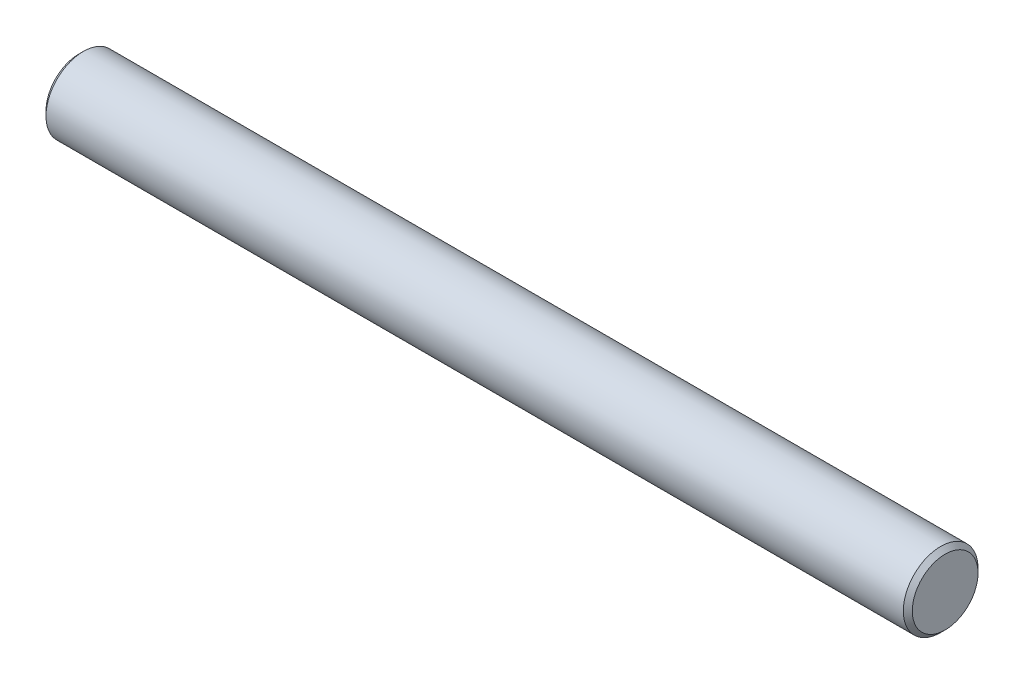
from build123d import *

# Parameters (mm, degrees)
ESQUISSE1_R        = 2.5
BOSS_EXTRU_1_DEPTH = 29
CHANFREIN1_SIZE    = 0.3


with BuildPart() as part:
    # Esquisse1 → Boss.-Extru.1 (new, symmetric)
    with BuildSketch(Plane(origin=(0, 0, 0), x_dir=(0, 0, -1), z_dir=(1, 0, 0))):
        with Locations(Location((0, 0, 0), (0, 0, 180))):
            Circle(ESQUISSE1_R)
    extrude(amount=BOSS_EXTRU_1_DEPTH, both=True)

    # Chanfrein1
    chanfrein1_edges = [part.edges().sort_by_distance(p)[0] for p in [
        (-29, 0, -2.5),
        (29, 0, -2.5),
    ]]
    chamfer(chanfrein1_edges, length=CHANFREIN1_SIZE)


solid = part.part
